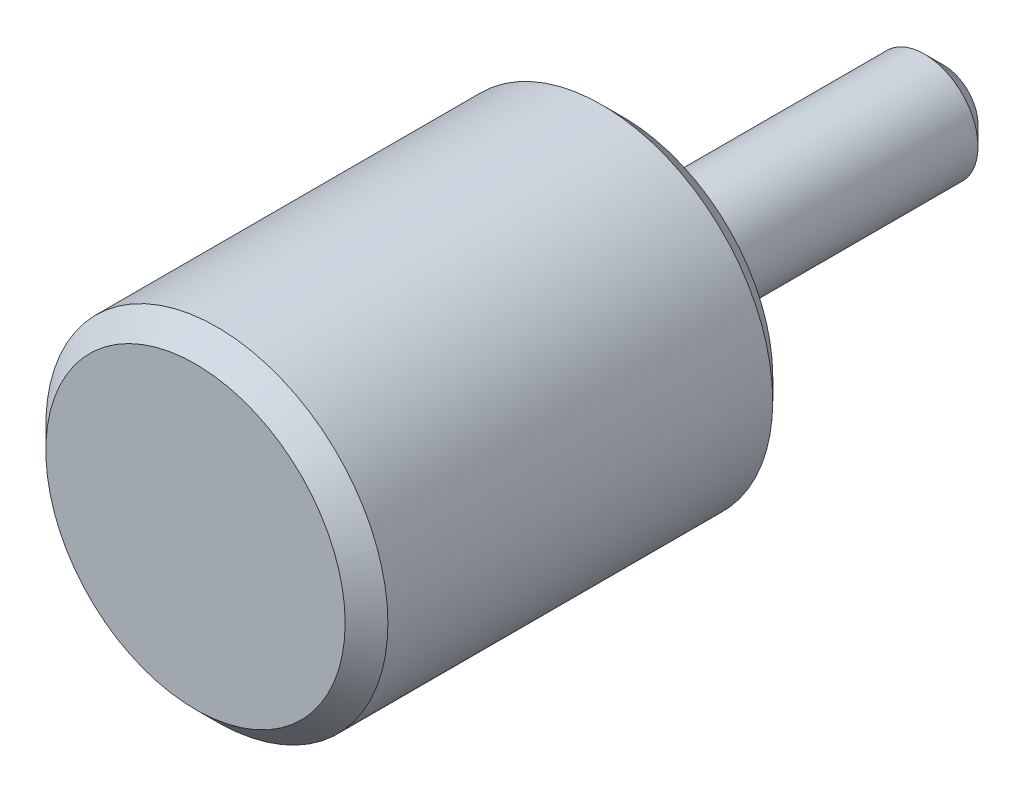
ISO-10303-21;
HEADER;
FILE_DESCRIPTION(('STEP AP214'),'2;1');
FILE_NAME('part.step','',(''),(''),'','','');
FILE_SCHEMA(('AUTOMOTIVE_DESIGN { 1 0 10303 214 1 1 1 1 }'));
ENDSEC;
DATA;
#1=APPLICATION_CONTEXT('core data for automotive mechanical design processes');
#2=APPLICATION_PROTOCOL_DEFINITION('international standard','automotive_design',2000,#1);
#3=PRODUCT_CONTEXT('',#1,'mechanical');
#4=PRODUCT('Part','Part','',(#3));
#5=PRODUCT_RELATED_PRODUCT_CATEGORY('part','',(#4));
#6=PRODUCT_DEFINITION_FORMATION('','',#4);
#7=PRODUCT_DEFINITION_CONTEXT('part definition',#1,'design');
#8=PRODUCT_DEFINITION('design','',#6,#7);
#9=PRODUCT_DEFINITION_SHAPE('','',#8);
#10=(LENGTH_UNIT() NAMED_UNIT(*) SI_UNIT(.MILLI.,.METRE.));
#11=(NAMED_UNIT(*) PLANE_ANGLE_UNIT() SI_UNIT($,.RADIAN.));
#12=(NAMED_UNIT(*) SI_UNIT($,.STERADIAN.) SOLID_ANGLE_UNIT());
#13=UNCERTAINTY_MEASURE_WITH_UNIT(LENGTH_MEASURE(1.E-05),#10,'distance_accuracy_value','');
#14=(GEOMETRIC_REPRESENTATION_CONTEXT(3) GLOBAL_UNCERTAINTY_ASSIGNED_CONTEXT((#13)) GLOBAL_UNIT_ASSIGNED_CONTEXT((#10,
#11,#12)) REPRESENTATION_CONTEXT('',''));
#15=CARTESIAN_POINT('',(0.,0.,0.));
#16=DIRECTION('',(0.,0.,1.));
#17=DIRECTION('',(1.,0.,0.));
#18=AXIS2_PLACEMENT_3D('',#15,#16,#17);
#19=CARTESIAN_POINT('',(0.,0.,20.));
#20=DIRECTION('',(0.,0.,-1.));
#21=DIRECTION('',(-1.,0.,0.));
#22=AXIS2_PLACEMENT_3D('',#19,#20,#21);
#23=CYLINDRICAL_SURFACE('',#22,8.);
#24=CARTESIAN_POINT('',(0.,0.,19.));
#25=DIRECTION('',(0.,0.,1.));
#26=DIRECTION('',(1.,0.,0.));
#27=AXIS2_PLACEMENT_3D('',#24,#25,#26);
#28=CIRCLE('',#27,8.);
#29=CARTESIAN_POINT('',(8.,0.,19.));
#30=VERTEX_POINT('',#29);
#31=EDGE_CURVE('E24',#30,#30,#28,.F.);
#32=ORIENTED_EDGE('',*,*,#31,.T.);
#33=EDGE_LOOP('',(#32));
#34=FACE_BOUND('',#33,.T.);
#35=CARTESIAN_POINT('',(0.,0.,1.));
#36=DIRECTION('',(0.,0.,1.));
#37=DIRECTION('',(1.,0.,0.));
#38=AXIS2_PLACEMENT_3D('',#35,#36,#37);
#39=CIRCLE('',#38,8.);
#40=CARTESIAN_POINT('',(8.,0.,1.));
#41=VERTEX_POINT('',#40);
#42=EDGE_CURVE('E35',#41,#41,#39,.T.);
#43=ORIENTED_EDGE('',*,*,#42,.T.);
#44=EDGE_LOOP('',(#43));
#45=FACE_BOUND('',#44,.T.);
#46=ADVANCED_FACE('F12',(#34,#45),#23,.T.);
#47=CARTESIAN_POINT('',(0.,0.,20.));
#48=DIRECTION('',(0.,0.,1.));
#49=DIRECTION('',(1.,0.,0.));
#50=AXIS2_PLACEMENT_3D('',#47,#48,#49);
#51=PLANE('',#50);
#52=CARTESIAN_POINT('',(0.,0.,20.));
#53=DIRECTION('',(0.,0.,1.));
#54=DIRECTION('',(1.,0.,0.));
#55=AXIS2_PLACEMENT_3D('',#52,#53,#54);
#56=CIRCLE('',#55,7.);
#57=CARTESIAN_POINT('',(7.,0.,20.));
#58=VERTEX_POINT('',#57);
#59=EDGE_CURVE('E29',#58,#58,#56,.T.);
#60=ORIENTED_EDGE('',*,*,#59,.T.);
#61=EDGE_LOOP('',(#60));
#62=FACE_BOUND('',#61,.T.);
#63=ADVANCED_FACE('F47',(#62),#51,.T.);
#64=CARTESIAN_POINT('',(0.,0.,0.));
#65=DIRECTION('',(0.,0.,1.));
#66=DIRECTION('',(1.,0.,0.));
#67=AXIS2_PLACEMENT_3D('',#64,#65,#66);
#68=PLANE('',#67);
#69=CARTESIAN_POINT('',(0.,0.,0.));
#70=DIRECTION('',(0.,0.,1.));
#71=DIRECTION('',(1.,0.,0.));
#72=AXIS2_PLACEMENT_3D('',#69,#70,#71);
#73=CIRCLE('',#72,7.);
#74=CARTESIAN_POINT('',(7.,0.,0.));
#75=VERTEX_POINT('',#74);
#76=EDGE_CURVE('E32',#75,#75,#73,.F.);
#77=ORIENTED_EDGE('',*,*,#76,.T.);
#78=EDGE_LOOP('',(#77));
#79=FACE_BOUND('',#78,.T.);
#80=CARTESIAN_POINT('',(0.,0.,0.));
#81=DIRECTION('',(0.,0.,-1.));
#82=DIRECTION('',(-1.,0.,0.));
#83=AXIS2_PLACEMENT_3D('',#80,#81,#82);
#84=CIRCLE('',#83,2.5);
#85=CARTESIAN_POINT('',(-2.5,0.,0.));
#86=VERTEX_POINT('',#85);
#87=EDGE_CURVE('E16',#86,#86,#84,.T.);
#88=ORIENTED_EDGE('',*,*,#87,.F.);
#89=EDGE_LOOP('',(#88));
#90=FACE_BOUND('',#89,.T.);
#91=ADVANCED_FACE('F44',(#79,#90),#68,.F.);
#92=CARTESIAN_POINT('',(0.,0.,1.));
#93=DIRECTION('',(0.,0.,1.));
#94=DIRECTION('',(1.,0.,0.));
#95=AXIS2_PLACEMENT_3D('',#92,#93,#94);
#96=CONICAL_SURFACE('',#95,8.,0.78539816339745);
#97=ORIENTED_EDGE('',*,*,#76,.F.);
#98=EDGE_LOOP('',(#97));
#99=FACE_BOUND('',#98,.T.);
#100=ORIENTED_EDGE('',*,*,#42,.F.);
#101=EDGE_LOOP('',(#100));
#102=FACE_BOUND('',#101,.T.);
#103=ADVANCED_FACE('F46',(#99,#102),#96,.T.);
#104=CARTESIAN_POINT('',(0.,0.,20.));
#105=DIRECTION('',(0.,0.,-1.));
#106=DIRECTION('',(-1.,0.,0.));
#107=AXIS2_PLACEMENT_3D('',#104,#105,#106);
#108=CONICAL_SURFACE('',#107,7.,0.785398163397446);
#109=ORIENTED_EDGE('',*,*,#31,.F.);
#110=EDGE_LOOP('',(#109));
#111=FACE_BOUND('',#110,.T.);
#112=ORIENTED_EDGE('',*,*,#59,.F.);
#113=EDGE_LOOP('',(#112));
#114=FACE_BOUND('',#113,.T.);
#115=ADVANCED_FACE('F55',(#111,#114),#108,.T.);
#116=CARTESIAN_POINT('',(0.,0.,-15.));
#117=DIRECTION('',(0.,0.,1.));
#118=DIRECTION('',(1.,0.,0.));
#119=AXIS2_PLACEMENT_3D('',#116,#117,#118);
#120=PLANE('',#119);
#121=CARTESIAN_POINT('',(0.,0.,-15.));
#122=DIRECTION('',(0.,0.,1.));
#123=DIRECTION('',(1.,0.,0.));
#124=AXIS2_PLACEMENT_3D('',#121,#122,#123);
#125=CIRCLE('',#124,1.6);
#126=CARTESIAN_POINT('',(1.6,0.,-15.));
#127=VERTEX_POINT('',#126);
#128=EDGE_CURVE('E8',#127,#127,#125,.F.);
#129=ORIENTED_EDGE('',*,*,#128,.T.);
#130=EDGE_LOOP('',(#129));
#131=FACE_BOUND('',#130,.T.);
#132=ADVANCED_FACE('F68',(#131),#120,.F.);
#133=CARTESIAN_POINT('',(0.,0.,-14.1));
#134=DIRECTION('',(0.,0.,1.));
#135=DIRECTION('',(1.,0.,0.));
#136=AXIS2_PLACEMENT_3D('',#133,#134,#135);
#137=CONICAL_SURFACE('',#136,2.5,0.785398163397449);
#138=ORIENTED_EDGE('',*,*,#128,.F.);
#139=EDGE_LOOP('',(#138));
#140=FACE_BOUND('',#139,.T.);
#141=CARTESIAN_POINT('',(0.,0.,-14.1));
#142=DIRECTION('',(0.,0.,1.));
#143=DIRECTION('',(1.,0.,0.));
#144=AXIS2_PLACEMENT_3D('',#141,#142,#143);
#145=CIRCLE('',#144,2.5);
#146=CARTESIAN_POINT('',(2.5,0.,-14.1));
#147=VERTEX_POINT('',#146);
#148=EDGE_CURVE('E20',#147,#147,#145,.T.);
#149=ORIENTED_EDGE('',*,*,#148,.F.);
#150=EDGE_LOOP('',(#149));
#151=FACE_BOUND('',#150,.T.);
#152=ADVANCED_FACE('F66',(#140,#151),#137,.T.);
#153=CARTESIAN_POINT('',(0.,0.,10.));
#154=DIRECTION('',(0.,0.,-1.));
#155=DIRECTION('',(-1.,0.,0.));
#156=AXIS2_PLACEMENT_3D('',#153,#154,#155);
#157=CYLINDRICAL_SURFACE('',#156,2.5);
#158=ORIENTED_EDGE('',*,*,#87,.T.);
#159=EDGE_LOOP('',(#158));
#160=FACE_BOUND('',#159,.T.);
#161=ORIENTED_EDGE('',*,*,#148,.T.);
#162=EDGE_LOOP('',(#161));
#163=FACE_BOUND('',#162,.T.);
#164=ADVANCED_FACE('F14',(#160,#163),#157,.T.);
#165=CLOSED_SHELL('',(#46,#63,#91,#103,#115,#132,#152,#164));
#166=MANIFOLD_SOLID_BREP('B1',#165);
#167=ADVANCED_BREP_SHAPE_REPRESENTATION('',(#18,#166),#14);
#168=SHAPE_DEFINITION_REPRESENTATION(#9,#167);
ENDSEC;
END-ISO-10303-21;
